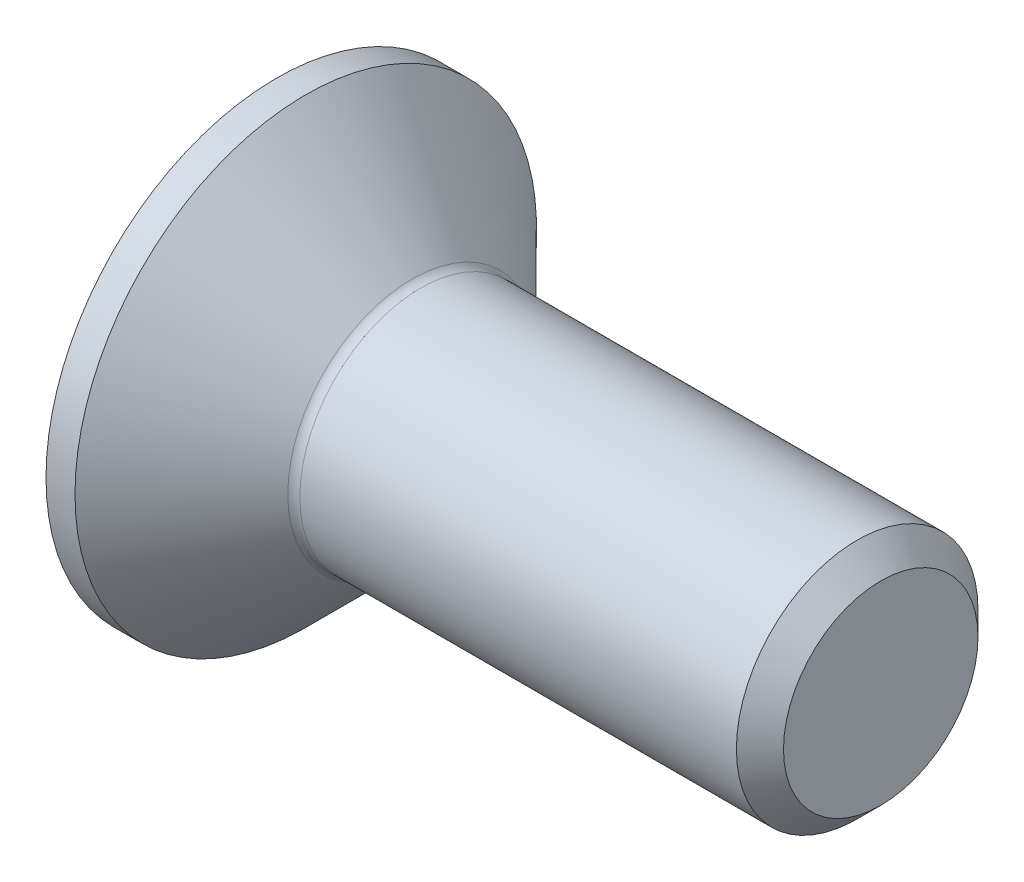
ISO-10303-21;
HEADER;
FILE_DESCRIPTION(('STEP AP214'),'2;1');
FILE_NAME('part.step','',(''),(''),'','','');
FILE_SCHEMA(('AUTOMOTIVE_DESIGN { 1 0 10303 214 1 1 1 1 }'));
ENDSEC;
DATA;
#1=APPLICATION_CONTEXT('core data for automotive mechanical design processes');
#2=APPLICATION_PROTOCOL_DEFINITION('international standard','automotive_design',2000,#1);
#3=PRODUCT_CONTEXT('',#1,'mechanical');
#4=PRODUCT('Part','Part','',(#3));
#5=PRODUCT_RELATED_PRODUCT_CATEGORY('part','',(#4));
#6=PRODUCT_DEFINITION_FORMATION('','',#4);
#7=PRODUCT_DEFINITION_CONTEXT('part definition',#1,'design');
#8=PRODUCT_DEFINITION('design','',#6,#7);
#9=PRODUCT_DEFINITION_SHAPE('','',#8);
#10=(LENGTH_UNIT() NAMED_UNIT(*) SI_UNIT(.MILLI.,.METRE.));
#11=(NAMED_UNIT(*) PLANE_ANGLE_UNIT() SI_UNIT($,.RADIAN.));
#12=(NAMED_UNIT(*) SI_UNIT($,.STERADIAN.) SOLID_ANGLE_UNIT());
#13=UNCERTAINTY_MEASURE_WITH_UNIT(LENGTH_MEASURE(1.E-05),#10,'distance_accuracy_value','');
#14=(GEOMETRIC_REPRESENTATION_CONTEXT(3) GLOBAL_UNCERTAINTY_ASSIGNED_CONTEXT((#13)) GLOBAL_UNIT_ASSIGNED_CONTEXT((#10,
#11,#12)) REPRESENTATION_CONTEXT('',''));
#15=CARTESIAN_POINT('',(0.,0.,0.));
#16=DIRECTION('',(0.,0.,1.));
#17=DIRECTION('',(1.,0.,0.));
#18=AXIS2_PLACEMENT_3D('',#15,#16,#17);
#19=CARTESIAN_POINT('',(0.,0.,0.));
#20=DIRECTION('',(-1.,0.,0.));
#21=DIRECTION('',(0.,0.,1.));
#22=AXIS2_PLACEMENT_3D('',#19,#20,#21);
#23=PLANE('',#22);
#24=CARTESIAN_POINT('',(0.,0.,0.));
#25=DIRECTION('',(-1.,0.,0.));
#26=DIRECTION('',(0.,0.,1.));
#27=AXIS2_PLACEMENT_3D('',#24,#25,#26);
#28=CIRCLE('',#27,3.82);
#29=CARTESIAN_POINT('',(0.,0.,3.82));
#30=VERTEX_POINT('',#29);
#31=EDGE_CURVE('E153',#30,#30,#28,.T.);
#32=ORIENTED_EDGE('',*,*,#31,.T.);
#33=EDGE_LOOP('',(#32));
#34=FACE_BOUND('',#33,.T.);
#35=DIRECTION('',(0.,-0.499999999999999,-0.866025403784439));
#36=VECTOR('',#35,1.);
#37=CARTESIAN_POINT('',(0.,-0.727461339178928,1.26));
#38=LINE('',#37,#36);
#39=CARTESIAN_POINT('',(0.,-0.727461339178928,1.26));
#40=VERTEX_POINT('',#39);
#41=CARTESIAN_POINT('',(0.,-1.45492267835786,0.));
#42=VERTEX_POINT('',#41);
#43=EDGE_CURVE('E119',#40,#42,#38,.T.);
#44=ORIENTED_EDGE('',*,*,#43,.T.);
#45=DIRECTION('',(0.,0.499999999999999,-0.866025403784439));
#46=VECTOR('',#45,1.);
#47=CARTESIAN_POINT('',(0.,-1.45492267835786,0.));
#48=LINE('',#47,#46);
#49=CARTESIAN_POINT('',(0.,-0.727461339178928,-1.26));
#50=VERTEX_POINT('',#49);
#51=EDGE_CURVE('E50',#42,#50,#48,.T.);
#52=ORIENTED_EDGE('',*,*,#51,.T.);
#53=DIRECTION('',(0.,1.,0.));
#54=VECTOR('',#53,1.);
#55=CARTESIAN_POINT('',(0.,-0.727461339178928,-1.26));
#56=LINE('',#55,#54);
#57=CARTESIAN_POINT('',(0.,0.72746133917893,-1.26));
#58=VERTEX_POINT('',#57);
#59=EDGE_CURVE('E130',#50,#58,#56,.T.);
#60=ORIENTED_EDGE('',*,*,#59,.T.);
#61=DIRECTION('',(0.,0.500000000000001,0.866025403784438));
#62=VECTOR('',#61,1.);
#63=CARTESIAN_POINT('',(0.,0.72746133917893,-1.26));
#64=LINE('',#63,#62);
#65=CARTESIAN_POINT('',(0.,1.45492267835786,0.));
#66=VERTEX_POINT('',#65);
#67=EDGE_CURVE('E254',#58,#66,#64,.T.);
#68=ORIENTED_EDGE('',*,*,#67,.T.);
#69=DIRECTION('',(0.,-0.5,0.866025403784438));
#70=VECTOR('',#69,1.);
#71=CARTESIAN_POINT('',(0.,1.45492267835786,0.));
#72=LINE('',#71,#70);
#73=CARTESIAN_POINT('',(0.,0.72746133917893,1.26));
#74=VERTEX_POINT('',#73);
#75=EDGE_CURVE('E257',#66,#74,#72,.T.);
#76=ORIENTED_EDGE('',*,*,#75,.T.);
#77=DIRECTION('',(0.,-1.,0.));
#78=VECTOR('',#77,1.);
#79=CARTESIAN_POINT('',(0.,0.72746133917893,1.26));
#80=LINE('',#79,#78);
#81=EDGE_CURVE('E260',#74,#40,#80,.T.);
#82=ORIENTED_EDGE('',*,*,#81,.T.);
#83=EDGE_LOOP('',(#44,#52,#60,#68,#76,#82));
#84=FACE_BOUND('',#83,.T.);
#85=ADVANCED_FACE('F35',(#34,#84),#23,.T.);
#86=CARTESIAN_POINT('',(0.,0.,0.));
#87=DIRECTION('',(-1.,0.,0.));
#88=DIRECTION('',(0.,0.,1.));
#89=AXIS2_PLACEMENT_3D('',#86,#87,#88);
#90=CYLINDRICAL_SURFACE('',#89,3.82);
#91=CARTESIAN_POINT('',(0.480000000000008,0.,0.));
#92=DIRECTION('',(-1.,0.,0.));
#93=DIRECTION('',(0.,0.,1.));
#94=AXIS2_PLACEMENT_3D('',#91,#92,#93);
#95=CIRCLE('',#94,3.82);
#96=CARTESIAN_POINT('',(0.480000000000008,0.,3.82));
#97=VERTEX_POINT('',#96);
#98=EDGE_CURVE('E150',#97,#97,#95,.T.);
#99=ORIENTED_EDGE('',*,*,#98,.T.);
#100=EDGE_LOOP('',(#99));
#101=FACE_BOUND('',#100,.T.);
#102=ORIENTED_EDGE('',*,*,#31,.F.);
#103=EDGE_LOOP('',(#102));
#104=FACE_BOUND('',#103,.T.);
#105=ADVANCED_FACE('F174',(#101,#104),#90,.T.);
#106=CARTESIAN_POINT('',(0.480000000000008,0.,0.));
#107=DIRECTION('',(-1.,0.,0.));
#108=DIRECTION('',(0.,0.,1.));
#109=AXIS2_PLACEMENT_3D('',#106,#107,#108);
#110=CONICAL_SURFACE('',#109,3.82,0.78539816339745);
#111=CARTESIAN_POINT('',(2.24142135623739,0.,0.));
#112=DIRECTION('',(-1.,0.,0.));
#113=DIRECTION('',(0.,0.,1.));
#114=AXIS2_PLACEMENT_3D('',#111,#112,#113);
#115=CIRCLE('',#114,2.05857864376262);
#116=CARTESIAN_POINT('',(2.24142135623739,0.,2.05857864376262));
#117=VERTEX_POINT('',#116);
#118=EDGE_CURVE('E43',#117,#117,#115,.T.);
#119=ORIENTED_EDGE('',*,*,#118,.T.);
#120=EDGE_LOOP('',(#119));
#121=FACE_BOUND('',#120,.T.);
#122=ORIENTED_EDGE('',*,*,#98,.F.);
#123=EDGE_LOOP('',(#122));
#124=FACE_BOUND('',#123,.T.);
#125=ADVANCED_FACE('F158',(#121,#124),#110,.T.);
#126=CARTESIAN_POINT('',(0.,0.,0.));
#127=DIRECTION('',(-1.,0.,0.));
#128=DIRECTION('',(0.,0.,1.));
#129=AXIS2_PLACEMENT_3D('',#126,#127,#128);
#130=CYLINDRICAL_SURFACE('',#129,1.99999999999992);
#131=CARTESIAN_POINT('',(2.3828427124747,0.,0.));
#132=DIRECTION('',(-1.,0.,0.));
#133=DIRECTION('',(0.,0.,1.));
#134=AXIS2_PLACEMENT_3D('',#131,#132,#133);
#135=CIRCLE('',#134,1.99999999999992);
#136=CARTESIAN_POINT('',(2.3828427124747,0.,1.99999999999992));
#137=VERTEX_POINT('',#136);
#138=EDGE_CURVE('E11',#137,#137,#135,.F.);
#139=ORIENTED_EDGE('',*,*,#138,.T.);
#140=EDGE_LOOP('',(#139));
#141=FACE_BOUND('',#140,.T.);
#142=CARTESIAN_POINT('',(9.60999999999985,0.,0.));
#143=DIRECTION('',(-1.,0.,0.));
#144=DIRECTION('',(0.,0.,1.));
#145=AXIS2_PLACEMENT_3D('',#142,#143,#144);
#146=CIRCLE('',#145,1.99999999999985);
#147=CARTESIAN_POINT('',(9.60999999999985,0.,1.99999999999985));
#148=VERTEX_POINT('',#147);
#149=EDGE_CURVE('E147',#148,#148,#146,.T.);
#150=ORIENTED_EDGE('',*,*,#149,.T.);
#151=EDGE_LOOP('',(#150));
#152=FACE_BOUND('',#151,.T.);
#153=ADVANCED_FACE('F185',(#141,#152),#130,.T.);
#154=CARTESIAN_POINT('',(10.,0.,0.));
#155=DIRECTION('',(-1.,0.,0.));
#156=DIRECTION('',(0.,0.,1.));
#157=AXIS2_PLACEMENT_3D('',#154,#155,#156);
#158=CONICAL_SURFACE('',#157,1.61,0.785398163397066);
#159=ORIENTED_EDGE('',*,*,#149,.F.);
#160=EDGE_LOOP('',(#159));
#161=FACE_BOUND('',#160,.T.);
#162=CARTESIAN_POINT('',(10.,0.,0.));
#163=DIRECTION('',(-1.,0.,0.));
#164=DIRECTION('',(0.,0.,1.));
#165=AXIS2_PLACEMENT_3D('',#162,#163,#164);
#166=CIRCLE('',#165,1.61);
#167=CARTESIAN_POINT('',(10.,0.,1.61));
#168=VERTEX_POINT('',#167);
#169=EDGE_CURVE('E143',#168,#168,#166,.T.);
#170=ORIENTED_EDGE('',*,*,#169,.T.);
#171=EDGE_LOOP('',(#170));
#172=FACE_BOUND('',#171,.T.);
#173=ADVANCED_FACE('F169',(#161,#172),#158,.T.);
#174=CARTESIAN_POINT('',(10.,1.61,0.));
#175=DIRECTION('',(1.,0.,0.));
#176=DIRECTION('',(0.,0.,-1.));
#177=AXIS2_PLACEMENT_3D('',#174,#175,#176);
#178=PLANE('',#177);
#179=ORIENTED_EDGE('',*,*,#169,.F.);
#180=EDGE_LOOP('',(#179));
#181=FACE_BOUND('',#180,.T.);
#182=ADVANCED_FACE('F162',(#181),#178,.T.);
#183=CARTESIAN_POINT('',(2.3828427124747,0.,0.));
#184=DIRECTION('',(-1.,0.,0.));
#185=DIRECTION('',(0.,0.,1.));
#186=AXIS2_PLACEMENT_3D('',#183,#184,#185);
#187=TOROIDAL_SURFACE('',#186,2.19999999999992,0.2);
#188=ORIENTED_EDGE('',*,*,#138,.F.);
#189=EDGE_LOOP('',(#188));
#190=FACE_BOUND('',#189,.T.);
#191=ORIENTED_EDGE('',*,*,#118,.F.);
#192=EDGE_LOOP('',(#191));
#193=FACE_BOUND('',#192,.T.);
#194=ADVANCED_FACE('F37',(#190,#193),#187,.F.);
#195=CARTESIAN_POINT('',(1.8,-1.45492267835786,0.));
#196=DIRECTION('',(0.,0.866025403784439,0.499999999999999));
#197=DIRECTION('',(0.,-0.499999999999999,0.866025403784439));
#198=AXIS2_PLACEMENT_3D('',#195,#196,#197);
#199=PLANE('',#198);
#200=ORIENTED_EDGE('',*,*,#51,.F.);
#201=DIRECTION('',(-1.,0.,0.));
#202=VECTOR('',#201,1.);
#203=CARTESIAN_POINT('',(1.8,-1.45492267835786,0.));
#204=LINE('',#203,#202);
#205=CARTESIAN_POINT('',(1.8,-1.45492267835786,0.));
#206=VERTEX_POINT('',#205);
#207=EDGE_CURVE('E251',#206,#42,#204,.T.);
#208=ORIENTED_EDGE('',*,*,#207,.F.);
#209=DIRECTION('',(0.,0.499999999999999,-0.866025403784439));
#210=VECTOR('',#209,1.);
#211=CARTESIAN_POINT('',(1.8,-1.45492267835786,0.));
#212=LINE('',#211,#210);
#213=CARTESIAN_POINT('',(1.8,-1.09119200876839,-0.629999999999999));
#214=VERTEX_POINT('',#213);
#215=EDGE_CURVE('E115',#206,#214,#212,.T.);
#216=ORIENTED_EDGE('',*,*,#215,.T.);
#217=CARTESIAN_POINT('',(1.8,-0.727461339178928,-1.26));
#218=VERTEX_POINT('',#217);
#219=EDGE_CURVE('E111',#214,#218,#212,.T.);
#220=ORIENTED_EDGE('',*,*,#219,.T.);
#221=DIRECTION('',(-1.,0.,0.));
#222=VECTOR('',#221,1.);
#223=CARTESIAN_POINT('',(1.8,-0.727461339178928,-1.26));
#224=LINE('',#223,#222);
#225=EDGE_CURVE('E113',#218,#50,#224,.T.);
#226=ORIENTED_EDGE('',*,*,#225,.T.);
#227=EDGE_LOOP('',(#200,#208,#216,#220,#226));
#228=FACE_BOUND('',#227,.T.);
#229=ADVANCED_FACE('F112',(#228),#199,.T.);
#230=CARTESIAN_POINT('',(1.8,-0.727461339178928,-1.26));
#231=DIRECTION('',(0.,0.,1.));
#232=DIRECTION('',(0.,-1.,0.));
#233=AXIS2_PLACEMENT_3D('',#230,#231,#232);
#234=PLANE('',#233);
#235=ORIENTED_EDGE('',*,*,#59,.F.);
#236=ORIENTED_EDGE('',*,*,#225,.F.);
#237=DIRECTION('',(0.,1.,0.));
#238=VECTOR('',#237,1.);
#239=CARTESIAN_POINT('',(1.8,-0.727461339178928,-1.26));
#240=LINE('',#239,#238);
#241=CARTESIAN_POINT('',(1.8,0.,-1.26));
#242=VERTEX_POINT('',#241);
#243=EDGE_CURVE('E58',#218,#242,#240,.T.);
#244=ORIENTED_EDGE('',*,*,#243,.T.);
#245=CARTESIAN_POINT('',(1.8,0.72746133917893,-1.26));
#246=VERTEX_POINT('',#245);
#247=EDGE_CURVE('E125',#242,#246,#240,.T.);
#248=ORIENTED_EDGE('',*,*,#247,.T.);
#249=DIRECTION('',(-1.,0.,0.));
#250=VECTOR('',#249,1.);
#251=CARTESIAN_POINT('',(1.8,0.72746133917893,-1.26));
#252=LINE('',#251,#250);
#253=EDGE_CURVE('E132',#246,#58,#252,.T.);
#254=ORIENTED_EDGE('',*,*,#253,.T.);
#255=EDGE_LOOP('',(#235,#236,#244,#248,#254));
#256=FACE_BOUND('',#255,.T.);
#257=ADVANCED_FACE('F127',(#256),#234,.T.);
#258=CARTESIAN_POINT('',(1.8,0.72746133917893,-1.26));
#259=DIRECTION('',(0.,-0.866025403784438,0.500000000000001));
#260=DIRECTION('',(0.,-0.500000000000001,-0.866025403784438));
#261=AXIS2_PLACEMENT_3D('',#258,#259,#260);
#262=PLANE('',#261);
#263=ORIENTED_EDGE('',*,*,#67,.F.);
#264=ORIENTED_EDGE('',*,*,#253,.F.);
#265=DIRECTION('',(0.,0.500000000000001,0.866025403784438));
#266=VECTOR('',#265,1.);
#267=CARTESIAN_POINT('',(1.8,0.72746133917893,-1.26));
#268=LINE('',#267,#266);
#269=CARTESIAN_POINT('',(1.8,1.09119200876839,-0.630000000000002));
#270=VERTEX_POINT('',#269);
#271=EDGE_CURVE('E232',#246,#270,#268,.T.);
#272=ORIENTED_EDGE('',*,*,#271,.T.);
#273=CARTESIAN_POINT('',(1.8,1.45492267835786,0.));
#274=VERTEX_POINT('',#273);
#275=EDGE_CURVE('E124',#270,#274,#268,.T.);
#276=ORIENTED_EDGE('',*,*,#275,.T.);
#277=DIRECTION('',(-1.,0.,0.));
#278=VECTOR('',#277,1.);
#279=CARTESIAN_POINT('',(1.8,1.45492267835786,0.));
#280=LINE('',#279,#278);
#281=EDGE_CURVE('E138',#274,#66,#280,.T.);
#282=ORIENTED_EDGE('',*,*,#281,.T.);
#283=EDGE_LOOP('',(#263,#264,#272,#276,#282));
#284=FACE_BOUND('',#283,.T.);
#285=ADVANCED_FACE('F199',(#284),#262,.T.);
#286=CARTESIAN_POINT('',(1.8,1.45492267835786,0.));
#287=DIRECTION('',(0.,-0.866025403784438,-0.5));
#288=DIRECTION('',(0.,0.5,-0.866025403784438));
#289=AXIS2_PLACEMENT_3D('',#286,#287,#288);
#290=PLANE('',#289);
#291=ORIENTED_EDGE('',*,*,#75,.F.);
#292=ORIENTED_EDGE('',*,*,#281,.F.);
#293=DIRECTION('',(0.,-0.5,0.866025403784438));
#294=VECTOR('',#293,1.);
#295=CARTESIAN_POINT('',(1.8,1.45492267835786,0.));
#296=LINE('',#295,#294);
#297=CARTESIAN_POINT('',(1.8,1.09119200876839,0.630000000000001));
#298=VERTEX_POINT('',#297);
#299=EDGE_CURVE('E239',#274,#298,#296,.T.);
#300=ORIENTED_EDGE('',*,*,#299,.T.);
#301=CARTESIAN_POINT('',(1.8,0.72746133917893,1.26));
#302=VERTEX_POINT('',#301);
#303=EDGE_CURVE('E237',#298,#302,#296,.T.);
#304=ORIENTED_EDGE('',*,*,#303,.T.);
#305=DIRECTION('',(-1.,0.,0.));
#306=VECTOR('',#305,1.);
#307=CARTESIAN_POINT('',(1.8,0.72746133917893,1.26));
#308=LINE('',#307,#306);
#309=EDGE_CURVE('E269',#302,#74,#308,.T.);
#310=ORIENTED_EDGE('',*,*,#309,.T.);
#311=EDGE_LOOP('',(#291,#292,#300,#304,#310));
#312=FACE_BOUND('',#311,.T.);
#313=ADVANCED_FACE('F202',(#312),#290,.T.);
#314=CARTESIAN_POINT('',(1.8,0.72746133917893,1.26));
#315=DIRECTION('',(0.,0.,-1.));
#316=DIRECTION('',(-1.,0.,0.));
#317=AXIS2_PLACEMENT_3D('',#314,#315,#316);
#318=PLANE('',#317);
#319=ORIENTED_EDGE('',*,*,#81,.F.);
#320=ORIENTED_EDGE('',*,*,#309,.F.);
#321=DIRECTION('',(0.,-1.,0.));
#322=VECTOR('',#321,1.);
#323=CARTESIAN_POINT('',(1.8,0.72746133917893,1.26));
#324=LINE('',#323,#322);
#325=CARTESIAN_POINT('',(1.8,0.,1.26));
#326=VERTEX_POINT('',#325);
#327=EDGE_CURVE('E244',#302,#326,#324,.T.);
#328=ORIENTED_EDGE('',*,*,#327,.T.);
#329=CARTESIAN_POINT('',(1.8,-0.727461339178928,1.26));
#330=VERTEX_POINT('',#329);
#331=EDGE_CURVE('E243',#326,#330,#324,.T.);
#332=ORIENTED_EDGE('',*,*,#331,.T.);
#333=DIRECTION('',(-1.,0.,0.));
#334=VECTOR('',#333,1.);
#335=CARTESIAN_POINT('',(1.8,-0.727461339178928,1.26));
#336=LINE('',#335,#334);
#337=EDGE_CURVE('E266',#330,#40,#336,.T.);
#338=ORIENTED_EDGE('',*,*,#337,.T.);
#339=EDGE_LOOP('',(#319,#320,#328,#332,#338));
#340=FACE_BOUND('',#339,.T.);
#341=ADVANCED_FACE('F206',(#340),#318,.T.);
#342=CARTESIAN_POINT('',(1.8,-0.727461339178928,1.26));
#343=DIRECTION('',(0.,0.866025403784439,-0.499999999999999));
#344=DIRECTION('',(0.,0.499999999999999,0.866025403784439));
#345=AXIS2_PLACEMENT_3D('',#342,#343,#344);
#346=PLANE('',#345);
#347=ORIENTED_EDGE('',*,*,#43,.F.);
#348=ORIENTED_EDGE('',*,*,#337,.F.);
#349=DIRECTION('',(0.,-0.499999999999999,-0.866025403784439));
#350=VECTOR('',#349,1.);
#351=CARTESIAN_POINT('',(1.8,-0.727461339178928,1.26));
#352=LINE('',#351,#350);
#353=CARTESIAN_POINT('',(1.8,-1.09119200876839,0.629999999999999));
#354=VERTEX_POINT('',#353);
#355=EDGE_CURVE('E248',#330,#354,#352,.T.);
#356=ORIENTED_EDGE('',*,*,#355,.T.);
#357=EDGE_CURVE('E247',#354,#206,#352,.T.);
#358=ORIENTED_EDGE('',*,*,#357,.T.);
#359=ORIENTED_EDGE('',*,*,#207,.T.);
#360=EDGE_LOOP('',(#347,#348,#356,#358,#359));
#361=FACE_BOUND('',#360,.T.);
#362=ADVANCED_FACE('F210',(#361),#346,.T.);
#363=CARTESIAN_POINT('',(1.8,-0.727461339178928,-1.26));
#364=DIRECTION('',(1.,0.,0.));
#365=DIRECTION('',(0.,0.,-1.));
#366=AXIS2_PLACEMENT_3D('',#363,#364,#365);
#367=PLANE('',#366);
#368=ORIENTED_EDGE('',*,*,#243,.F.);
#369=ORIENTED_EDGE('',*,*,#219,.F.);
#370=CARTESIAN_POINT('',(1.8,0.,0.));
#371=DIRECTION('',(-1.,0.,0.));
#372=DIRECTION('',(0.,0.,1.));
#373=AXIS2_PLACEMENT_3D('',#370,#371,#372);
#374=CIRCLE('',#373,1.26);
#375=EDGE_CURVE('E122',#242,#214,#374,.T.);
#376=ORIENTED_EDGE('',*,*,#375,.F.);
#377=EDGE_LOOP('',(#368,#369,#376));
#378=FACE_BOUND('',#377,.T.);
#379=ADVANCED_FACE('F121',(#378),#367,.F.);
#380=ORIENTED_EDGE('',*,*,#215,.F.);
#381=ORIENTED_EDGE('',*,*,#357,.F.);
#382=EDGE_CURVE('E135',#214,#354,#374,.T.);
#383=ORIENTED_EDGE('',*,*,#382,.F.);
#384=EDGE_LOOP('',(#380,#381,#383));
#385=FACE_BOUND('',#384,.T.);
#386=ADVANCED_FACE('F216',(#385),#367,.F.);
#387=ORIENTED_EDGE('',*,*,#355,.F.);
#388=ORIENTED_EDGE('',*,*,#331,.F.);
#389=EDGE_CURVE('E131',#354,#326,#374,.T.);
#390=ORIENTED_EDGE('',*,*,#389,.F.);
#391=EDGE_LOOP('',(#387,#388,#390));
#392=FACE_BOUND('',#391,.T.);
#393=ADVANCED_FACE('F220',(#392),#367,.F.);
#394=ORIENTED_EDGE('',*,*,#327,.F.);
#395=ORIENTED_EDGE('',*,*,#303,.F.);
#396=EDGE_CURVE('E137',#326,#298,#374,.T.);
#397=ORIENTED_EDGE('',*,*,#396,.F.);
#398=EDGE_LOOP('',(#394,#395,#397));
#399=FACE_BOUND('',#398,.T.);
#400=ADVANCED_FACE('F228',(#399),#367,.F.);
#401=ORIENTED_EDGE('',*,*,#299,.F.);
#402=ORIENTED_EDGE('',*,*,#275,.F.);
#403=EDGE_CURVE('E144',#298,#270,#374,.T.);
#404=ORIENTED_EDGE('',*,*,#403,.F.);
#405=EDGE_LOOP('',(#401,#402,#404));
#406=FACE_BOUND('',#405,.T.);
#407=ADVANCED_FACE('F223',(#406),#367,.F.);
#408=ORIENTED_EDGE('',*,*,#271,.F.);
#409=ORIENTED_EDGE('',*,*,#247,.F.);
#410=EDGE_CURVE('E233',#270,#242,#374,.T.);
#411=ORIENTED_EDGE('',*,*,#410,.F.);
#412=EDGE_LOOP('',(#408,#409,#411));
#413=FACE_BOUND('',#412,.T.);
#414=ADVANCED_FACE('F194',(#413),#367,.F.);
#415=CARTESIAN_POINT('',(1.8,0.,0.));
#416=DIRECTION('',(-1.,0.,0.));
#417=DIRECTION('',(0.,0.,1.));
#418=AXIS2_PLACEMENT_3D('',#415,#416,#417);
#419=CONICAL_SURFACE('',#418,1.26,1.04719755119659);
#420=CARTESIAN_POINT('',(2.52746133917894,0.,0.));
#421=VERTEX_POINT('',#420);
#422=VERTEX_LOOP('',#421);
#423=FACE_BOUND('',#422,.T.);
#424=ORIENTED_EDGE('',*,*,#396,.T.);
#425=ORIENTED_EDGE('',*,*,#403,.T.);
#426=ORIENTED_EDGE('',*,*,#410,.T.);
#427=ORIENTED_EDGE('',*,*,#375,.T.);
#428=ORIENTED_EDGE('',*,*,#382,.T.);
#429=ORIENTED_EDGE('',*,*,#389,.T.);
#430=EDGE_LOOP('',(#424,#425,#426,#427,#428,#429));
#431=FACE_BOUND('',#430,.T.);
#432=ADVANCED_FACE('F192',(#423,#431),#419,.F.);
#433=CLOSED_SHELL('',(#85,#105,#125,#153,#173,#182,#194,#229,#257,#285,#313,#341,#362,#379,#386,
#393,#400,#407,#414,#432));
#434=MANIFOLD_SOLID_BREP('B2',#433);
#435=ADVANCED_BREP_SHAPE_REPRESENTATION('',(#18,#434),#14);
#436=SHAPE_DEFINITION_REPRESENTATION(#9,#435);
ENDSEC;
END-ISO-10303-21;
